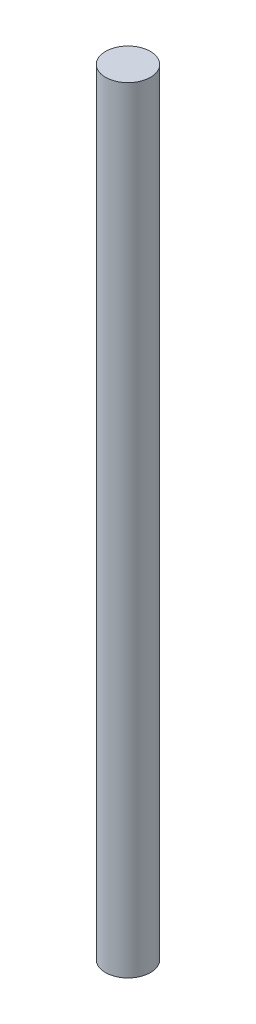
from build123d import *

# Parameters (mm, degrees)
SKETCH1_R      = 6.35
EXTRUDE1_DEPTH = 219.202


with BuildPart() as part:
    # Sketch1 → Extrude1 (new body)
    with BuildSketch(Plane(origin=(0, -109.544212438, 0), x_dir=(-1, 0, 0), z_dir=(0, 1, 0))):
        with Locations(Location((0, 0, 0), (0, 0, 90))):
            Circle(SKETCH1_R)
    extrude(amount=EXTRUDE1_DEPTH)


solid = part.part
